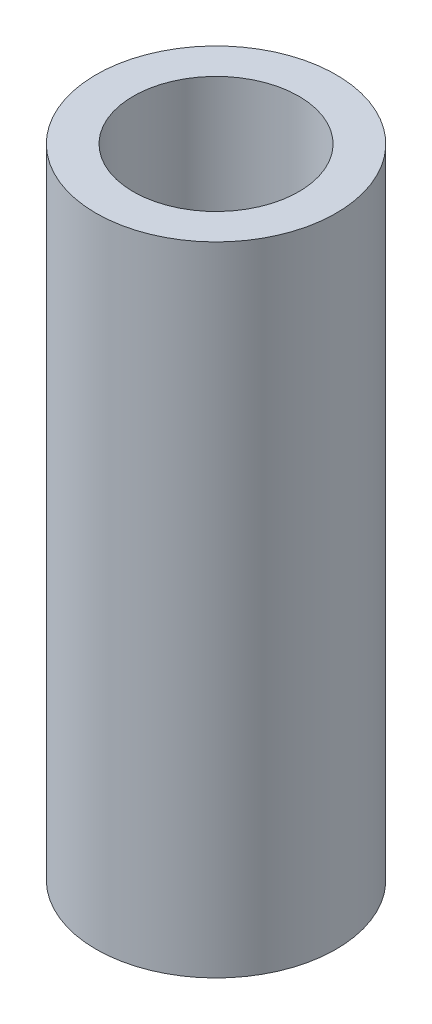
ISO-10303-21;
HEADER;
FILE_DESCRIPTION(('STEP AP214'),'2;1');
FILE_NAME('part.step','',(''),(''),'','','');
FILE_SCHEMA(('AUTOMOTIVE_DESIGN { 1 0 10303 214 1 1 1 1 }'));
ENDSEC;
DATA;
#1=APPLICATION_CONTEXT('core data for automotive mechanical design processes');
#2=APPLICATION_PROTOCOL_DEFINITION('international standard','automotive_design',2000,#1);
#3=PRODUCT_CONTEXT('',#1,'mechanical');
#4=PRODUCT('Part','Part','',(#3));
#5=PRODUCT_RELATED_PRODUCT_CATEGORY('part','',(#4));
#6=PRODUCT_DEFINITION_FORMATION('','',#4);
#7=PRODUCT_DEFINITION_CONTEXT('part definition',#1,'design');
#8=PRODUCT_DEFINITION('design','',#6,#7);
#9=PRODUCT_DEFINITION_SHAPE('','',#8);
#10=(LENGTH_UNIT() NAMED_UNIT(*) SI_UNIT(.MILLI.,.METRE.));
#11=(NAMED_UNIT(*) PLANE_ANGLE_UNIT() SI_UNIT($,.RADIAN.));
#12=(NAMED_UNIT(*) SI_UNIT($,.STERADIAN.) SOLID_ANGLE_UNIT());
#13=UNCERTAINTY_MEASURE_WITH_UNIT(LENGTH_MEASURE(1.E-05),#10,'distance_accuracy_value','');
#14=(GEOMETRIC_REPRESENTATION_CONTEXT(3) GLOBAL_UNCERTAINTY_ASSIGNED_CONTEXT((#13)) GLOBAL_UNIT_ASSIGNED_CONTEXT((#10,
#11,#12)) REPRESENTATION_CONTEXT('',''));
#15=CARTESIAN_POINT('',(0.,0.,0.));
#16=DIRECTION('',(0.,0.,1.));
#17=DIRECTION('',(1.,0.,0.));
#18=AXIS2_PLACEMENT_3D('',#15,#16,#17);
#19=CARTESIAN_POINT('',(0.,19.25,0.));
#20=DIRECTION('',(0.,1.,0.));
#21=DIRECTION('',(0.,0.,1.));
#22=AXIS2_PLACEMENT_3D('',#19,#20,#21);
#23=PLANE('',#22);
#24=CARTESIAN_POINT('',(0.,19.25,0.));
#25=DIRECTION('',(0.,1.,0.));
#26=DIRECTION('',(0.,0.,1.));
#27=AXIS2_PLACEMENT_3D('',#24,#25,#26);
#28=CIRCLE('',#27,7.25);
#29=CARTESIAN_POINT('',(0.,19.25,7.25));
#30=VERTEX_POINT('',#29);
#31=EDGE_CURVE('E10',#30,#30,#28,.T.);
#32=ORIENTED_EDGE('',*,*,#31,.T.);
#33=EDGE_LOOP('',(#32));
#34=FACE_BOUND('',#33,.T.);
#35=CARTESIAN_POINT('',(0.,19.25,0.));
#36=DIRECTION('',(0.,1.,0.));
#37=DIRECTION('',(0.,0.,1.));
#38=AXIS2_PLACEMENT_3D('',#35,#36,#37);
#39=CIRCLE('',#38,5.);
#40=CARTESIAN_POINT('',(0.,19.25,5.));
#41=VERTEX_POINT('',#40);
#42=EDGE_CURVE('E48',#41,#41,#39,.T.);
#43=ORIENTED_EDGE('',*,*,#42,.F.);
#44=EDGE_LOOP('',(#43));
#45=FACE_BOUND('',#44,.T.);
#46=ADVANCED_FACE('F34',(#34,#45),#23,.T.);
#47=CARTESIAN_POINT('',(0.,-19.25,0.));
#48=DIRECTION('',(0.,1.,0.));
#49=DIRECTION('',(0.,0.,1.));
#50=AXIS2_PLACEMENT_3D('',#47,#48,#49);
#51=PLANE('',#50);
#52=CARTESIAN_POINT('',(0.,-19.25,0.));
#53=DIRECTION('',(0.,1.,0.));
#54=DIRECTION('',(0.,0.,1.));
#55=AXIS2_PLACEMENT_3D('',#52,#53,#54);
#56=CIRCLE('',#55,7.25);
#57=CARTESIAN_POINT('',(0.,-19.25,7.25));
#58=VERTEX_POINT('',#57);
#59=EDGE_CURVE('E38',#58,#58,#56,.T.);
#60=ORIENTED_EDGE('',*,*,#59,.F.);
#61=EDGE_LOOP('',(#60));
#62=FACE_BOUND('',#61,.T.);
#63=CARTESIAN_POINT('',(0.,-19.25,0.));
#64=DIRECTION('',(0.,1.,0.));
#65=DIRECTION('',(0.,0.,1.));
#66=AXIS2_PLACEMENT_3D('',#63,#64,#65);
#67=CIRCLE('',#66,5.);
#68=CARTESIAN_POINT('',(0.,-19.25,5.));
#69=VERTEX_POINT('',#68);
#70=EDGE_CURVE('E50',#69,#69,#67,.T.);
#71=ORIENTED_EDGE('',*,*,#70,.T.);
#72=EDGE_LOOP('',(#71));
#73=FACE_BOUND('',#72,.T.);
#74=ADVANCED_FACE('F63',(#62,#73),#51,.F.);
#75=CARTESIAN_POINT('',(0.,19.25,0.));
#76=DIRECTION('',(0.,-1.,0.));
#77=DIRECTION('',(0.,0.,-1.));
#78=AXIS2_PLACEMENT_3D('',#75,#76,#77);
#79=CYLINDRICAL_SURFACE('',#78,7.25);
#80=ORIENTED_EDGE('',*,*,#31,.F.);
#81=EDGE_LOOP('',(#80));
#82=FACE_BOUND('',#81,.T.);
#83=ORIENTED_EDGE('',*,*,#59,.T.);
#84=EDGE_LOOP('',(#83));
#85=FACE_BOUND('',#84,.T.);
#86=ADVANCED_FACE('F36',(#82,#85),#79,.T.);
#87=CARTESIAN_POINT('',(0.,19.25,0.));
#88=DIRECTION('',(0.,-1.,0.));
#89=DIRECTION('',(0.,0.,-1.));
#90=AXIS2_PLACEMENT_3D('',#87,#88,#89);
#91=CYLINDRICAL_SURFACE('',#90,5.);
#92=ORIENTED_EDGE('',*,*,#42,.T.);
#93=EDGE_LOOP('',(#92));
#94=FACE_BOUND('',#93,.T.);
#95=ORIENTED_EDGE('',*,*,#70,.F.);
#96=EDGE_LOOP('',(#95));
#97=FACE_BOUND('',#96,.T.);
#98=ADVANCED_FACE('F59',(#94,#97),#91,.F.);
#99=CLOSED_SHELL('',(#46,#74,#86,#98));
#100=MANIFOLD_SOLID_BREP('B2',#99);
#101=ADVANCED_BREP_SHAPE_REPRESENTATION('',(#18,#100),#14);
#102=SHAPE_DEFINITION_REPRESENTATION(#9,#101);
ENDSEC;
END-ISO-10303-21;
